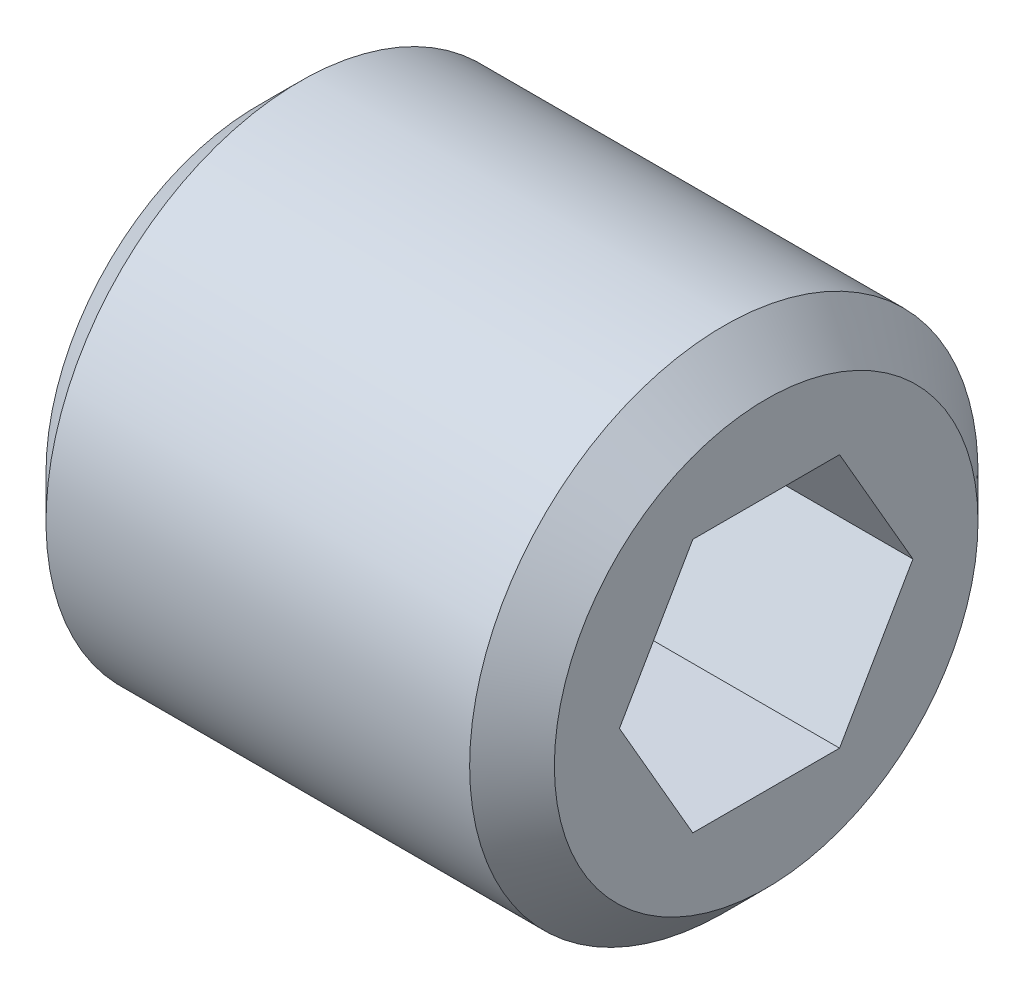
ISO-10303-21;
HEADER;
FILE_DESCRIPTION(('STEP AP214'),'2;1');
FILE_NAME('part.step','',(''),(''),'','','');
FILE_SCHEMA(('AUTOMOTIVE_DESIGN { 1 0 10303 214 1 1 1 1 }'));
ENDSEC;
DATA;
#1=APPLICATION_CONTEXT('core data for automotive mechanical design processes');
#2=APPLICATION_PROTOCOL_DEFINITION('international standard','automotive_design',2000,#1);
#3=PRODUCT_CONTEXT('',#1,'mechanical');
#4=PRODUCT('Part','Part','',(#3));
#5=PRODUCT_RELATED_PRODUCT_CATEGORY('part','',(#4));
#6=PRODUCT_DEFINITION_FORMATION('','',#4);
#7=PRODUCT_DEFINITION_CONTEXT('part definition',#1,'design');
#8=PRODUCT_DEFINITION('design','',#6,#7);
#9=PRODUCT_DEFINITION_SHAPE('','',#8);
#10=(LENGTH_UNIT() NAMED_UNIT(*) SI_UNIT(.MILLI.,.METRE.));
#11=(NAMED_UNIT(*) PLANE_ANGLE_UNIT() SI_UNIT($,.RADIAN.));
#12=(NAMED_UNIT(*) SI_UNIT($,.STERADIAN.) SOLID_ANGLE_UNIT());
#13=UNCERTAINTY_MEASURE_WITH_UNIT(LENGTH_MEASURE(1.E-05),#10,'distance_accuracy_value','');
#14=(GEOMETRIC_REPRESENTATION_CONTEXT(3) GLOBAL_UNCERTAINTY_ASSIGNED_CONTEXT((#13)) GLOBAL_UNIT_ASSIGNED_CONTEXT((#10,
#11,#12)) REPRESENTATION_CONTEXT('',''));
#15=CARTESIAN_POINT('',(0.,0.,0.));
#16=DIRECTION('',(0.,0.,1.));
#17=DIRECTION('',(1.,0.,0.));
#18=AXIS2_PLACEMENT_3D('',#15,#16,#17);
#19=CARTESIAN_POINT('',(-4.8602519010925,-0.0099999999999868,0.86602540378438));
#20=DIRECTION('',(-0.86602540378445,-0.49999999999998,0.));
#21=DIRECTION('',(0.,0.,-1.));
#22=AXIS2_PLACEMENT_3D('',#19,#20,#21);
#23=PLANE('',#22);
#24=DIRECTION('',(0.,0.,-1.));
#25=VECTOR('',#24,1.);
#26=CARTESIAN_POINT('',(-4.,-1.5000000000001,-1.13397459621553));
#27=LINE('',#26,#25);
#28=CARTESIAN_POINT('',(-3.99999999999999,-1.50000000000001,0.866025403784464));
#29=VERTEX_POINT('',#28);
#30=CARTESIAN_POINT('',(-4.,-1.50000000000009,-0.866025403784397));
#31=VERTEX_POINT('',#30);
#32=EDGE_CURVE('E186',#29,#31,#27,.T.);
#33=ORIENTED_EDGE('',*,*,#32,.T.);
#34=DIRECTION('',(-0.447213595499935,0.774596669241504,0.447213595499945));
#35=VECTOR('',#34,1.);
#36=CARTESIAN_POINT('',(-4.00000000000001,-1.50000000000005,-0.866025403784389));
#37=LINE('',#36,#35);
#38=CARTESIAN_POINT('',(-4.8602519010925,-0.0100000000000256,-0.0057735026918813));
#39=VERTEX_POINT('',#38);
#40=EDGE_CURVE('E21',#31,#39,#37,.T.);
#41=ORIENTED_EDGE('',*,*,#40,.T.);
#42=DIRECTION('',(0.,0.,-1.));
#43=VECTOR('',#42,1.);
#44=CARTESIAN_POINT('',(-4.8602519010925,-0.0100000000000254,0.));
#45=LINE('',#44,#43);
#46=CARTESIAN_POINT('',(-4.8602519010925,-0.0100000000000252,0.00577350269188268));
#47=VERTEX_POINT('',#46);
#48=EDGE_CURVE('E156',#47,#39,#45,.T.);
#49=ORIENTED_EDGE('',*,*,#48,.F.);
#50=DIRECTION('',(0.447213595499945,-0.77459666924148,0.447213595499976));
#51=VECTOR('',#50,1.);
#52=CARTESIAN_POINT('',(-4.8602519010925,-0.0100000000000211,0.00577350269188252));
#53=LINE('',#52,#51);
#54=EDGE_CURVE('E148',#47,#29,#53,.T.);
#55=ORIENTED_EDGE('',*,*,#54,.T.);
#56=EDGE_LOOP('',(#33,#41,#49,#55));
#57=FACE_BOUND('',#56,.T.);
#58=ADVANCED_FACE('F17',(#57),#23,.F.);
#59=CARTESIAN_POINT('',(-4.8602519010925,-0.75500000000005,0.42435244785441));
#60=DIRECTION('',(-0.866025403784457,-0.249999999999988,-0.43301270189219));
#61=DIRECTION('',(0.,0.866025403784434,-0.500000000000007));
#62=AXIS2_PLACEMENT_3D('',#59,#60,#61);
#63=PLANE('',#62);
#64=DIRECTION('',(0.,0.86602540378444,-0.499999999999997));
#65=VECTOR('',#64,1.);
#66=CARTESIAN_POINT('',(-4.,0.2320508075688,-1.86602540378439));
#67=LINE('',#66,#65);
#68=CARTESIAN_POINT('',(-4.,0.,-1.7320508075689));
#69=VERTEX_POINT('',#68);
#70=EDGE_CURVE('E71',#31,#69,#67,.T.);
#71=ORIENTED_EDGE('',*,*,#70,.T.);
#72=DIRECTION('',(-0.447213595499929,0.,0.89442719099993));
#73=VECTOR('',#72,1.);
#74=CARTESIAN_POINT('',(-4.00000000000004,0.,-1.73205080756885));
#75=LINE('',#74,#73);
#76=CARTESIAN_POINT('',(-4.8602519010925,0.,-0.0115470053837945));
#77=VERTEX_POINT('',#76);
#78=EDGE_CURVE('E146',#69,#77,#75,.T.);
#79=ORIENTED_EDGE('',*,*,#78,.T.);
#80=DIRECTION('',(0.,0.866025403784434,-0.500000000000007));
#81=VECTOR('',#80,1.);
#82=CARTESIAN_POINT('',(-4.8602519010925,-0.00500000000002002,-0.00866025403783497));
#83=LINE('',#82,#81);
#84=EDGE_CURVE('E155',#39,#77,#83,.T.);
#85=ORIENTED_EDGE('',*,*,#84,.F.);
#86=ORIENTED_EDGE('',*,*,#40,.F.);
#87=EDGE_LOOP('',(#71,#79,#85,#86));
#88=FACE_BOUND('',#87,.T.);
#89=ADVANCED_FACE('F199',(#88),#63,.F.);
#90=CARTESIAN_POINT('',(-4.8602519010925,0.745,0.44167295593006));
#91=DIRECTION('',(-0.866025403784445,-0.249999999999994,0.43301270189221));
#92=DIRECTION('',(0.,-0.866025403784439,-0.499999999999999));
#93=AXIS2_PLACEMENT_3D('',#90,#91,#92);
#94=PLANE('',#93);
#95=DIRECTION('',(0.,-0.86602540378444,-0.499999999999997));
#96=VECTOR('',#95,1.);
#97=CARTESIAN_POINT('',(-4.,-1.7320508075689,0.732050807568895));
#98=LINE('',#97,#96);
#99=CARTESIAN_POINT('',(-3.99999999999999,0.,1.73205080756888));
#100=VERTEX_POINT('',#99);
#101=EDGE_CURVE('E169',#100,#29,#98,.T.);
#102=ORIENTED_EDGE('',*,*,#101,.T.);
#103=ORIENTED_EDGE('',*,*,#54,.F.);
#104=DIRECTION('',(0.,-0.866025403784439,-0.499999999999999));
#105=VECTOR('',#104,1.);
#106=CARTESIAN_POINT('',(-4.8602519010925,0.745,0.441672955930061));
#107=LINE('',#106,#105);
#108=CARTESIAN_POINT('',(-4.8602519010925,0.,0.011547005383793));
#109=VERTEX_POINT('',#108);
#110=EDGE_CURVE('E141',#47,#109,#107,.F.);
#111=ORIENTED_EDGE('',*,*,#110,.T.);
#112=DIRECTION('',(0.447213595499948,0.,0.894427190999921));
#113=VECTOR('',#112,1.);
#114=CARTESIAN_POINT('',(-4.8602519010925,0.,0.0115470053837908));
#115=LINE('',#114,#113);
#116=EDGE_CURVE('E137',#109,#100,#115,.T.);
#117=ORIENTED_EDGE('',*,*,#116,.T.);
#118=EDGE_LOOP('',(#102,#103,#111,#117));
#119=FACE_BOUND('',#118,.T.);
#120=ADVANCED_FACE('F206',(#119),#94,.F.);
#121=CARTESIAN_POINT('',(-4.8602519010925,-0.74500000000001,-0.44167295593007));
#122=DIRECTION('',(-0.866025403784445,0.249999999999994,-0.43301270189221));
#123=DIRECTION('',(0.,0.86602540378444,0.499999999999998));
#124=AXIS2_PLACEMENT_3D('',#121,#122,#123);
#125=PLANE('',#124);
#126=DIRECTION('',(0.,0.866025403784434,0.500000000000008));
#127=VECTOR('',#126,1.);
#128=CARTESIAN_POINT('',(-4.,1.73205080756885,-0.732050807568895));
#129=LINE('',#128,#127);
#130=CARTESIAN_POINT('',(-3.99999999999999,1.5,-0.866025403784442));
#131=VERTEX_POINT('',#130);
#132=EDGE_CURVE('E172',#69,#131,#129,.T.);
#133=ORIENTED_EDGE('',*,*,#132,.T.);
#134=DIRECTION('',(-0.447213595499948,-0.774596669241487,0.447213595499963));
#135=VECTOR('',#134,1.);
#136=CARTESIAN_POINT('',(-3.99999999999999,1.49999999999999,-0.866025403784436));
#137=LINE('',#136,#135);
#138=CARTESIAN_POINT('',(-4.8602519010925,0.010000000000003,-0.0057735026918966));
#139=VERTEX_POINT('',#138);
#140=EDGE_CURVE('E134',#131,#139,#137,.T.);
#141=ORIENTED_EDGE('',*,*,#140,.T.);
#142=DIRECTION('',(0.,0.86602540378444,0.499999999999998));
#143=VECTOR('',#142,1.);
#144=CARTESIAN_POINT('',(-4.8602519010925,-0.74500000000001,-0.44167295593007));
#145=LINE('',#144,#143);
#146=EDGE_CURVE('E143',#139,#77,#145,.F.);
#147=ORIENTED_EDGE('',*,*,#146,.T.);
#148=ORIENTED_EDGE('',*,*,#78,.F.);
#149=EDGE_LOOP('',(#133,#141,#147,#148));
#150=FACE_BOUND('',#149,.T.);
#151=ADVANCED_FACE('F197',(#150),#125,.F.);
#152=CARTESIAN_POINT('',(-4.8602519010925,-0.015490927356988,0.0017841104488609));
#153=DIRECTION('',(-1.,0.,0.));
#154=DIRECTION('',(0.,0.809016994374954,0.587785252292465));
#155=AXIS2_PLACEMENT_3D('',#152,#153,#154);
#156=PLANE('',#155);
#157=DIRECTION('',(0.,-0.866025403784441,0.499999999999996));
#158=VECTOR('',#157,1.);
#159=CARTESIAN_POINT('',(-4.8602519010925,0.00500000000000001,0.00866025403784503));
#160=LINE('',#159,#158);
#161=CARTESIAN_POINT('',(-4.8602519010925,0.0100000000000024,0.00577350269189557));
#162=VERTEX_POINT('',#161);
#163=EDGE_CURVE('E140',#162,#109,#160,.T.);
#164=ORIENTED_EDGE('',*,*,#163,.T.);
#165=ORIENTED_EDGE('',*,*,#110,.F.);
#166=ORIENTED_EDGE('',*,*,#48,.T.);
#167=ORIENTED_EDGE('',*,*,#84,.T.);
#168=ORIENTED_EDGE('',*,*,#146,.F.);
#169=DIRECTION('',(0.,0.,1.));
#170=VECTOR('',#169,1.);
#171=CARTESIAN_POINT('',(-4.8602519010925,0.0099999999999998,0.));
#172=LINE('',#171,#170);
#173=EDGE_CURVE('E133',#139,#162,#172,.T.);
#174=ORIENTED_EDGE('',*,*,#173,.T.);
#175=EDGE_LOOP('',(#164,#165,#166,#167,#168,#174));
#176=FACE_BOUND('',#175,.T.);
#177=ADVANCED_FACE('F212',(#176),#156,.F.);
#178=CARTESIAN_POINT('',(-4.8602519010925,0.755,-0.42435244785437));
#179=DIRECTION('',(-0.866025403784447,0.249999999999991,0.433012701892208));
#180=DIRECTION('',(0.,-0.866025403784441,0.499999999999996));
#181=AXIS2_PLACEMENT_3D('',#178,#179,#180);
#182=PLANE('',#181);
#183=DIRECTION('',(0.,-0.866025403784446,0.499999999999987));
#184=VECTOR('',#183,1.);
#185=CARTESIAN_POINT('',(-4.,-0.2320508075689,1.86602540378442));
#186=LINE('',#185,#184);
#187=CARTESIAN_POINT('',(-3.99999999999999,1.5,0.866025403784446));
#188=VERTEX_POINT('',#187);
#189=EDGE_CURVE('E35',#188,#100,#186,.T.);
#190=ORIENTED_EDGE('',*,*,#189,.T.);
#191=ORIENTED_EDGE('',*,*,#116,.F.);
#192=ORIENTED_EDGE('',*,*,#163,.F.);
#193=DIRECTION('',(0.447213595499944,0.774596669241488,0.447213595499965));
#194=VECTOR('',#193,1.);
#195=CARTESIAN_POINT('',(-4.8602519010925,0.0100000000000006,0.00577350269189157));
#196=LINE('',#195,#194);
#197=EDGE_CURVE('E129',#162,#188,#196,.T.);
#198=ORIENTED_EDGE('',*,*,#197,.T.);
#199=EDGE_LOOP('',(#190,#191,#192,#198));
#200=FACE_BOUND('',#199,.T.);
#201=ADVANCED_FACE('F211',(#200),#182,.F.);
#202=CARTESIAN_POINT('',(-4.8602519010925,0.01,-0.86602540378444));
#203=DIRECTION('',(-0.866025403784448,0.499999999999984,0.));
#204=DIRECTION('',(0.,0.,1.));
#205=AXIS2_PLACEMENT_3D('',#202,#203,#204);
#206=PLANE('',#205);
#207=ORIENTED_EDGE('',*,*,#173,.F.);
#208=ORIENTED_EDGE('',*,*,#140,.F.);
#209=DIRECTION('',(0.,0.,1.));
#210=VECTOR('',#209,1.);
#211=CARTESIAN_POINT('',(-4.,1.5,1.13397459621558));
#212=LINE('',#211,#210);
#213=EDGE_CURVE('E27',#131,#188,#212,.T.);
#214=ORIENTED_EDGE('',*,*,#213,.T.);
#215=ORIENTED_EDGE('',*,*,#197,.F.);
#216=EDGE_LOOP('',(#207,#208,#214,#215));
#217=FACE_BOUND('',#216,.T.);
#218=ADVANCED_FACE('F194',(#217),#206,.F.);
#219=CARTESIAN_POINT('',(-6.,-3.7615884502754,0.5957770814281));
#220=DIRECTION('',(-1.,0.,0.));
#221=DIRECTION('',(0.,0.809016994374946,0.587785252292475));
#222=AXIS2_PLACEMENT_3D('',#219,#220,#221);
#223=PLANE('',#222);
#224=CARTESIAN_POINT('',(-6.,0.,0.));
#225=DIRECTION('',(1.,0.,0.));
#226=DIRECTION('',(0.,0.,-1.));
#227=AXIS2_PLACEMENT_3D('',#224,#225,#226);
#228=CIRCLE('',#227,2.50000000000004);
#229=CARTESIAN_POINT('',(-6.,0.,-2.50000000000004));
#230=VERTEX_POINT('',#229);
#231=EDGE_CURVE('E125',#230,#230,#228,.F.);
#232=ORIENTED_EDGE('',*,*,#231,.T.);
#233=EDGE_LOOP('',(#232));
#234=FACE_BOUND('',#233,.T.);
#235=ADVANCED_FACE('F239',(#234),#223,.T.);
#236=CARTESIAN_POINT('',(-5.5,0.,0.));
#237=DIRECTION('',(1.,0.,0.));
#238=DIRECTION('',(0.,0.,-1.));
#239=AXIS2_PLACEMENT_3D('',#236,#237,#238);
#240=CONICAL_SURFACE('',#239,2.99999999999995,0.785398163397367);
#241=CARTESIAN_POINT('',(-5.5,0.,0.));
#242=DIRECTION('',(-1.,0.,0.));
#243=DIRECTION('',(0.,0.809016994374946,0.587785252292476));
#244=AXIS2_PLACEMENT_3D('',#241,#242,#243);
#245=CIRCLE('',#244,2.99999999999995);
#246=CARTESIAN_POINT('',(-5.5,2.4270509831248,1.7633557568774));
#247=VERTEX_POINT('',#246);
#248=EDGE_CURVE('E128',#247,#247,#245,.T.);
#249=ORIENTED_EDGE('',*,*,#248,.T.);
#250=EDGE_LOOP('',(#249));
#251=FACE_BOUND('',#250,.T.);
#252=ORIENTED_EDGE('',*,*,#231,.F.);
#253=EDGE_LOOP('',(#252));
#254=FACE_BOUND('',#253,.T.);
#255=ADVANCED_FACE('F242',(#251,#254),#240,.T.);
#256=CARTESIAN_POINT('',(-0.5,0.,0.));
#257=DIRECTION('',(-1.,0.,0.));
#258=DIRECTION('',(0.,0.,1.));
#259=AXIS2_PLACEMENT_3D('',#256,#257,#258);
#260=CYLINDRICAL_SURFACE('',#259,2.99999999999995);
#261=CARTESIAN_POINT('',(-0.5,0.,0.));
#262=DIRECTION('',(-1.,0.,0.));
#263=DIRECTION('',(0.,0.809016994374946,0.587785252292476));
#264=AXIS2_PLACEMENT_3D('',#261,#262,#263);
#265=CIRCLE('',#264,2.99999999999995);
#266=CARTESIAN_POINT('',(-0.5,2.4270509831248,1.7633557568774));
#267=VERTEX_POINT('',#266);
#268=EDGE_CURVE('E122',#267,#267,#265,.T.);
#269=ORIENTED_EDGE('',*,*,#268,.T.);
#270=EDGE_LOOP('',(#269));
#271=FACE_BOUND('',#270,.T.);
#272=ORIENTED_EDGE('',*,*,#248,.F.);
#273=EDGE_LOOP('',(#272));
#274=FACE_BOUND('',#273,.T.);
#275=ADVANCED_FACE('F287',(#271,#274),#260,.T.);
#276=CARTESIAN_POINT('',(0.,0.,0.));
#277=DIRECTION('',(-1.,0.,0.));
#278=DIRECTION('',(0.,0.,1.));
#279=AXIS2_PLACEMENT_3D('',#276,#277,#278);
#280=CONICAL_SURFACE('',#279,2.50000000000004,0.785398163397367);
#281=CARTESIAN_POINT('',(0.,0.,0.));
#282=DIRECTION('',(-1.,0.,0.));
#283=DIRECTION('',(0.,0.,1.));
#284=AXIS2_PLACEMENT_3D('',#281,#282,#283);
#285=CIRCLE('',#284,2.50000000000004);
#286=CARTESIAN_POINT('',(0.,0.,2.50000000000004));
#287=VERTEX_POINT('',#286);
#288=EDGE_CURVE('E104',#287,#287,#285,.F.);
#289=ORIENTED_EDGE('',*,*,#288,.F.);
#290=EDGE_LOOP('',(#289));
#291=FACE_BOUND('',#290,.T.);
#292=ORIENTED_EDGE('',*,*,#268,.F.);
#293=EDGE_LOOP('',(#292));
#294=FACE_BOUND('',#293,.T.);
#295=ADVANCED_FACE('F238',(#291,#294),#280,.T.);
#296=CARTESIAN_POINT('',(0.,-0.5957770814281,-3.7615884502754));
#297=DIRECTION('',(1.,0.,0.));
#298=DIRECTION('',(0.,0.809016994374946,0.587785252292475));
#299=AXIS2_PLACEMENT_3D('',#296,#297,#298);
#300=PLANE('',#299);
#301=DIRECTION('',(0.,0.866025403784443,0.499999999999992));
#302=VECTOR('',#301,1.);
#303=CARTESIAN_POINT('',(0.,-1.50000000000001,0.866025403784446));
#304=LINE('',#303,#302);
#305=CARTESIAN_POINT('',(0.,-1.50000000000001,0.866025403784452));
#306=VERTEX_POINT('',#305);
#307=CARTESIAN_POINT('',(0.,0.,1.73205080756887));
#308=VERTEX_POINT('',#307);
#309=EDGE_CURVE('E116',#306,#308,#304,.T.);
#310=ORIENTED_EDGE('',*,*,#309,.T.);
#311=DIRECTION('',(0.,0.866025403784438,-0.5));
#312=VECTOR('',#311,1.);
#313=CARTESIAN_POINT('',(0.,0.,1.73205080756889));
#314=LINE('',#313,#312);
#315=CARTESIAN_POINT('',(0.,1.50000000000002,0.866025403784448));
#316=VERTEX_POINT('',#315);
#317=EDGE_CURVE('E101',#308,#316,#314,.T.);
#318=ORIENTED_EDGE('',*,*,#317,.T.);
#319=DIRECTION('',(0.,0.,-1.));
#320=VECTOR('',#319,1.);
#321=CARTESIAN_POINT('',(0.,1.50000000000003,0.866025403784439));
#322=LINE('',#321,#320);
#323=CARTESIAN_POINT('',(0.,1.50000000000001,-0.866025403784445));
#324=VERTEX_POINT('',#323);
#325=EDGE_CURVE('E93',#316,#324,#322,.T.);
#326=ORIENTED_EDGE('',*,*,#325,.T.);
#327=DIRECTION('',(0.,-0.866025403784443,-0.499999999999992));
#328=VECTOR('',#327,1.);
#329=CARTESIAN_POINT('',(0.,1.50000000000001,-0.866025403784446));
#330=LINE('',#329,#328);
#331=CARTESIAN_POINT('',(0.,0.,-1.73205080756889));
#332=VERTEX_POINT('',#331);
#333=EDGE_CURVE('E98',#324,#332,#330,.T.);
#334=ORIENTED_EDGE('',*,*,#333,.T.);
#335=DIRECTION('',(0.,-0.866025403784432,0.500000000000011));
#336=VECTOR('',#335,1.);
#337=CARTESIAN_POINT('',(0.,0.,-1.73205080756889));
#338=LINE('',#337,#336);
#339=CARTESIAN_POINT('',(0.,-1.50000000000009,-0.866025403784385));
#340=VERTEX_POINT('',#339);
#341=EDGE_CURVE('E80',#332,#340,#338,.T.);
#342=ORIENTED_EDGE('',*,*,#341,.T.);
#343=DIRECTION('',(0.,0.,1.));
#344=VECTOR('',#343,1.);
#345=CARTESIAN_POINT('',(0.,-1.5000000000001,-1.13397459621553));
#346=LINE('',#345,#344);
#347=EDGE_CURVE('E184',#340,#306,#346,.T.);
#348=ORIENTED_EDGE('',*,*,#347,.T.);
#349=EDGE_LOOP('',(#310,#318,#326,#334,#342,#348));
#350=FACE_BOUND('',#349,.T.);
#351=ORIENTED_EDGE('',*,*,#288,.T.);
#352=EDGE_LOOP('',(#351));
#353=FACE_BOUND('',#352,.T.);
#354=ADVANCED_FACE('F95',(#350,#353),#300,.T.);
#355=CARTESIAN_POINT('',(0.,-1.5,0.86602540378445));
#356=DIRECTION('',(0.,-1.,0.));
#357=DIRECTION('',(-1.,0.,0.));
#358=AXIS2_PLACEMENT_3D('',#355,#356,#357);
#359=PLANE('',#358);
#360=DIRECTION('',(-1.,0.,0.));
#361=VECTOR('',#360,1.);
#362=CARTESIAN_POINT('',(-2.,-1.5000000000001,-0.86602540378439));
#363=LINE('',#362,#361);
#364=EDGE_CURVE('E163',#340,#31,#363,.T.);
#365=ORIENTED_EDGE('',*,*,#364,.T.);
#366=ORIENTED_EDGE('',*,*,#32,.F.);
#367=DIRECTION('',(1.,0.,0.));
#368=VECTOR('',#367,1.);
#369=CARTESIAN_POINT('',(-2.,-1.50000000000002,0.866025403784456));
#370=LINE('',#369,#368);
#371=EDGE_CURVE('E166',#29,#306,#370,.T.);
#372=ORIENTED_EDGE('',*,*,#371,.T.);
#373=ORIENTED_EDGE('',*,*,#347,.F.);
#374=EDGE_LOOP('',(#365,#366,#372,#373));
#375=FACE_BOUND('',#374,.T.);
#376=ADVANCED_FACE('F204',(#375),#359,.F.);
#377=CARTESIAN_POINT('',(0.,-1.5000000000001,-0.86602540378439));
#378=DIRECTION('',(0.,-0.499999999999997,-0.86602540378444));
#379=DIRECTION('',(-1.,0.,0.));
#380=AXIS2_PLACEMENT_3D('',#377,#378,#379);
#381=PLANE('',#380);
#382=DIRECTION('',(-1.,0.,0.));
#383=VECTOR('',#382,1.);
#384=CARTESIAN_POINT('',(-2.,0.,-1.7320508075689));
#385=LINE('',#384,#383);
#386=EDGE_CURVE('E114',#332,#69,#385,.T.);
#387=ORIENTED_EDGE('',*,*,#386,.T.);
#388=ORIENTED_EDGE('',*,*,#70,.F.);
#389=ORIENTED_EDGE('',*,*,#364,.F.);
#390=ORIENTED_EDGE('',*,*,#341,.F.);
#391=EDGE_LOOP('',(#387,#388,#389,#390));
#392=FACE_BOUND('',#391,.T.);
#393=ADVANCED_FACE('F201',(#392),#381,.F.);
#394=CARTESIAN_POINT('',(0.,0.,1.7320508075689));
#395=DIRECTION('',(0.,-0.499999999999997,0.86602540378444));
#396=DIRECTION('',(-1.,0.,0.));
#397=AXIS2_PLACEMENT_3D('',#394,#395,#396);
#398=PLANE('',#397);
#399=ORIENTED_EDGE('',*,*,#371,.F.);
#400=ORIENTED_EDGE('',*,*,#101,.F.);
#401=DIRECTION('',(1.,0.,0.));
#402=VECTOR('',#401,1.);
#403=CARTESIAN_POINT('',(-2.,0.,1.73205080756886));
#404=LINE('',#403,#402);
#405=EDGE_CURVE('E111',#100,#308,#404,.T.);
#406=ORIENTED_EDGE('',*,*,#405,.T.);
#407=ORIENTED_EDGE('',*,*,#309,.F.);
#408=EDGE_LOOP('',(#399,#400,#406,#407));
#409=FACE_BOUND('',#408,.T.);
#410=ADVANCED_FACE('F189',(#409),#398,.F.);
#411=CARTESIAN_POINT('',(0.,0.,-1.7320508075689));
#412=DIRECTION('',(0.,0.500000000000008,-0.866025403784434));
#413=DIRECTION('',(-1.,0.,0.));
#414=AXIS2_PLACEMENT_3D('',#411,#412,#413);
#415=PLANE('',#414);
#416=DIRECTION('',(-1.,0.,0.));
#417=VECTOR('',#416,1.);
#418=CARTESIAN_POINT('',(-2.,1.5,-0.86602540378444));
#419=LINE('',#418,#417);
#420=EDGE_CURVE('E107',#324,#131,#419,.T.);
#421=ORIENTED_EDGE('',*,*,#420,.T.);
#422=ORIENTED_EDGE('',*,*,#132,.F.);
#423=ORIENTED_EDGE('',*,*,#386,.F.);
#424=ORIENTED_EDGE('',*,*,#333,.F.);
#425=EDGE_LOOP('',(#421,#422,#423,#424));
#426=FACE_BOUND('',#425,.T.);
#427=ADVANCED_FACE('F113',(#426),#415,.F.);
#428=CARTESIAN_POINT('',(0.,1.5,0.86602540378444));
#429=DIRECTION('',(0.,0.499999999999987,0.866025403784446));
#430=DIRECTION('',(-1.,0.,0.));
#431=AXIS2_PLACEMENT_3D('',#428,#429,#430);
#432=PLANE('',#431);
#433=ORIENTED_EDGE('',*,*,#405,.F.);
#434=ORIENTED_EDGE('',*,*,#189,.F.);
#435=DIRECTION('',(1.,0.,0.));
#436=VECTOR('',#435,1.);
#437=CARTESIAN_POINT('',(-2.,1.5,0.866025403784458));
#438=LINE('',#437,#436);
#439=EDGE_CURVE('E11',#188,#316,#438,.T.);
#440=ORIENTED_EDGE('',*,*,#439,.T.);
#441=ORIENTED_EDGE('',*,*,#317,.F.);
#442=EDGE_LOOP('',(#433,#434,#440,#441));
#443=FACE_BOUND('',#442,.T.);
#444=ADVANCED_FACE('F190',(#443),#432,.F.);
#445=CARTESIAN_POINT('',(0.,1.5,-0.86602540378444));
#446=DIRECTION('',(0.,1.,0.));
#447=DIRECTION('',(-1.,0.,0.));
#448=AXIS2_PLACEMENT_3D('',#445,#446,#447);
#449=PLANE('',#448);
#450=ORIENTED_EDGE('',*,*,#439,.F.);
#451=ORIENTED_EDGE('',*,*,#213,.F.);
#452=ORIENTED_EDGE('',*,*,#420,.F.);
#453=ORIENTED_EDGE('',*,*,#325,.F.);
#454=EDGE_LOOP('',(#450,#451,#452,#453));
#455=FACE_BOUND('',#454,.T.);
#456=ADVANCED_FACE('F19',(#455),#449,.F.);
#457=CLOSED_SHELL('',(#58,#89,#120,#151,#177,#201,#218,#235,#255,#275,#295,#354,#376,#393,#410,
#427,#444,#456));
#458=MANIFOLD_SOLID_BREP('B1',#457);
#459=ADVANCED_BREP_SHAPE_REPRESENTATION('',(#18,#458),#14);
#460=SHAPE_DEFINITION_REPRESENTATION(#9,#459);
ENDSEC;
END-ISO-10303-21;
